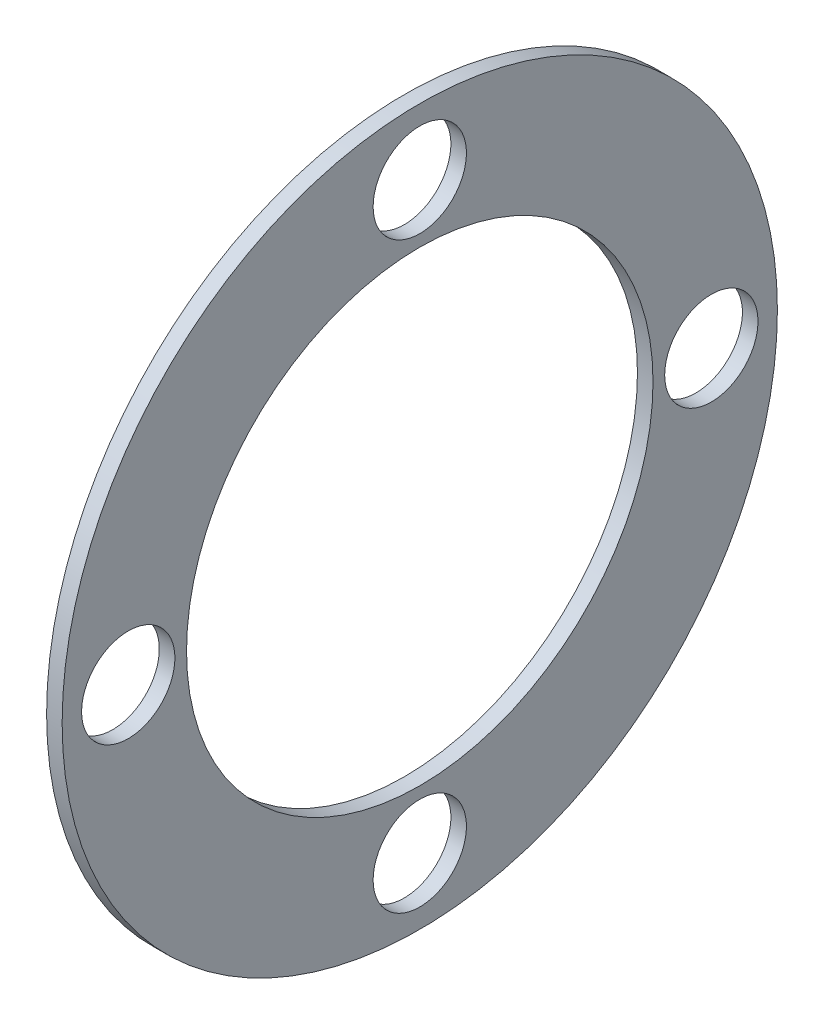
from build123d import *

# Parameters (mm, degrees)
SKETCH2_W          = 2
SKETCH2_H          = 46
CUT_EXTRUDE1_REACH = 67.085
SKETCH5_R          = 6
CUT_EXTRUDE2_REACH = 67.085
SKETCH6_R          = 30


with BuildPart() as part:
    # Sketch2 → Revolve1 (revolve)
    with BuildSketch(Plane.XY, mode=Mode.PRIVATE) as revolve1_sk:
        with Locations((1, 23)):
            Rectangle(SKETCH2_W, SKETCH2_H)
    revolve(revolve1_sk.sketch.rotate(Axis((29.906992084, 0, 0), (-1, 0, 0)), 90), axis=Axis((29.906992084, 0, 0), (-1, 0, 0)))

    # Sketch5 → Cut-Extrude1 (cut, up to next)
    with BuildSketch(Plane.ZY, mode=Mode.PRIVATE) as cut_extrude1_sk1:
        with Locations((0, 37.5)):
            Circle(SKETCH5_R)
    cut_extrude1_tool1 = extrude(cut_extrude1_sk1.sketch, amount=-CUT_EXTRUDE1_REACH, mode=Mode.PRIVATE) & part.part
    # Sketch5 → Cut-Extrude1 (cut, up to next)
    with BuildSketch(Plane.ZY, mode=Mode.PRIVATE) as cut_extrude1_sk2:
        with Locations((37.5, 0)):
            Circle(SKETCH5_R)
    cut_extrude1_tool2 = extrude(cut_extrude1_sk2.sketch, amount=-CUT_EXTRUDE1_REACH, mode=Mode.PRIVATE) & part.part
    # Sketch5 → Cut-Extrude1 (cut, up to next)
    with BuildSketch(Plane.ZY, mode=Mode.PRIVATE) as cut_extrude1_sk3:
        with Locations((0, -37.5)):
            Circle(SKETCH5_R)
    cut_extrude1_tool3 = extrude(cut_extrude1_sk3.sketch, amount=-CUT_EXTRUDE1_REACH, mode=Mode.PRIVATE) & part.part
    # Sketch5 → Cut-Extrude1 (cut, up to next)
    with BuildSketch(Plane.ZY, mode=Mode.PRIVATE) as cut_extrude1_sk4:
        with Locations((-37.5, 0)):
            Circle(SKETCH5_R)
    cut_extrude1_tool4 = extrude(cut_extrude1_sk4.sketch, amount=-CUT_EXTRUDE1_REACH, mode=Mode.PRIVATE) & part.part
    add(cut_extrude1_tool1.solids().sort_by_distance((0, 37.5, 0))[0], mode=Mode.SUBTRACT)
    add(cut_extrude1_tool2.solids().sort_by_distance((0, 0, 37.5))[0], mode=Mode.SUBTRACT)
    add(cut_extrude1_tool3.solids().sort_by_distance((0, -37.5, 0))[0], mode=Mode.SUBTRACT)
    add(cut_extrude1_tool4.solids().sort_by_distance((0, 0, -37.5))[0], mode=Mode.SUBTRACT)

    # Sketch6 → Cut-Extrude2 (cut, up to next)
    with BuildSketch(Plane.ZY, mode=Mode.PRIVATE) as cut_extrude2_sk1:
        Circle(SKETCH6_R)
    cut_extrude2_tool1 = extrude(cut_extrude2_sk1.sketch, amount=-CUT_EXTRUDE2_REACH, mode=Mode.PRIVATE) & part.part
    add(cut_extrude2_tool1.solids().sort_by_distance((0, 0, 0))[0], mode=Mode.SUBTRACT)


solid = part.part
